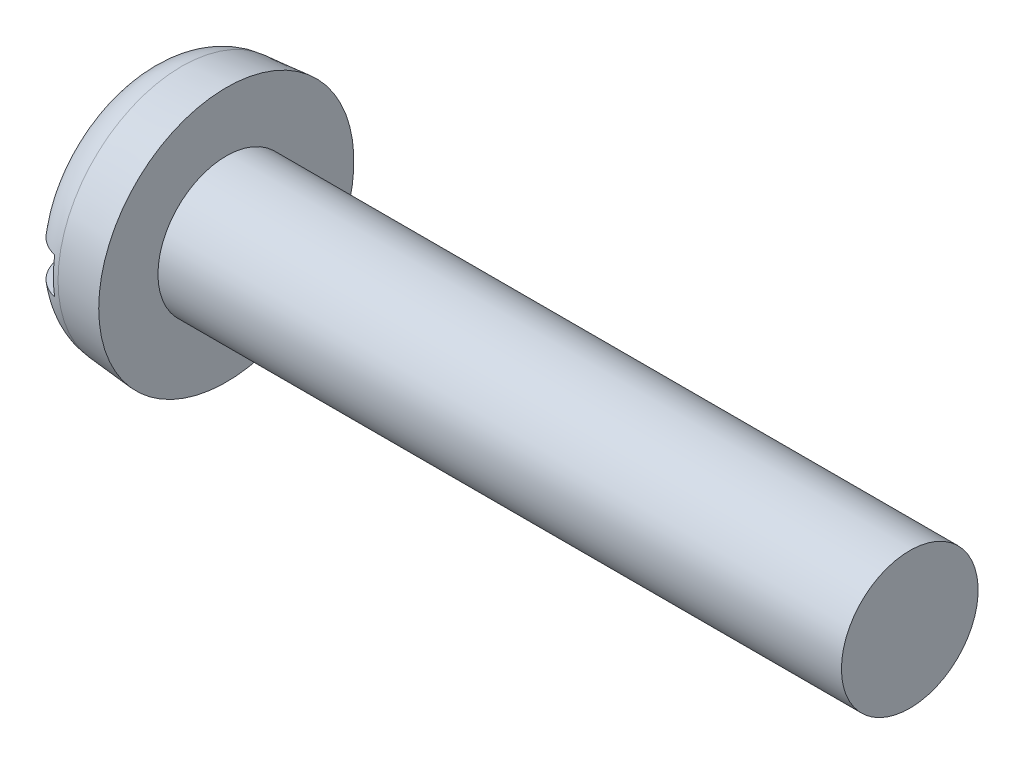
from build123d import *

# Parameters (mm, degrees)
FILLET2_R  = 0.9
SKETCH2_W  = 5.6
SKETCH2_H  = 0.8
SLOT_DEPTH = 0.7


with BuildPart() as part:
    # BodySke → Base-Revolve (revolve)
    with BuildSketch(Plane.XY, mode=Mode.PRIVATE) as base_revolve_sk:
        Polygon((1.8, 1.5), (1.8, 2.8), (0, 2.642520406), (0, 0), (16.8, 0), (16.8, 1.5), align=None)
    revolve(base_revolve_sk.sketch.rotate(Axis((-25.4, 0, 0), (1, 0, 0)), 90), axis=Axis((-25.4, 0, 0), (1, 0, 0)))

    # Fillet2
    fillet2_edges = [part.edges().sort_by_distance(p)[0] for p in [
        (0, 0, -2.642520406),
    ]]
    fillet(fillet2_edges, radius=FILLET2_R)

    # Sketch2 → Slot (cut)
    with BuildSketch(Plane(origin=(0, 0, 0), x_dir=(0, 0, -1), z_dir=(1, 0, 0))):
        Rectangle(SKETCH2_W, SKETCH2_H)
    extrude(amount=SLOT_DEPTH, mode=Mode.SUBTRACT)


solid = part.part
